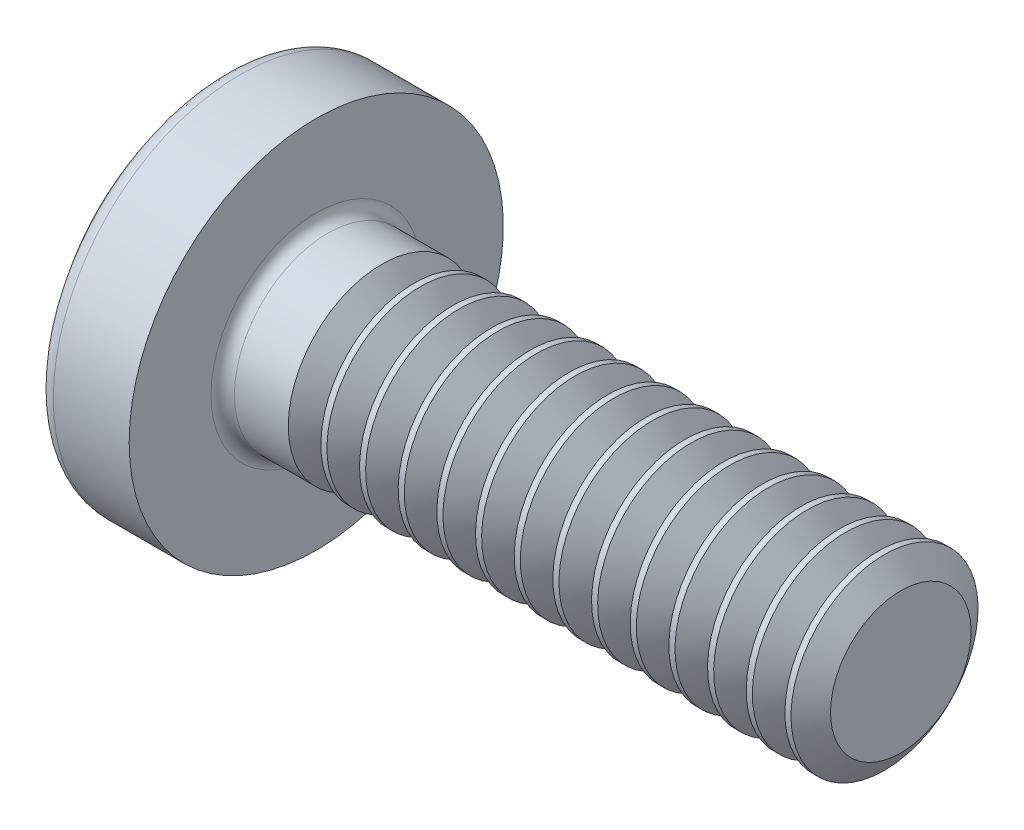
from build123d import *

# Parameters (mm, degrees)
FILLET1_R       = 0.1
RECPAT_COUNT    = 2
RECPAT_ANGLE    = 90
THDSCHPAT_COUNT = 14
THDSCHPAT_PITCH = 0.330769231


with BuildPart() as part:
    # BodySke → Base-Revolve (revolve)
    with BuildSketch(Plane.XY, mode=Mode.PRIVATE) as base_revolve_sk:
        with BuildLine():
            Line((1.3, 0.8), (1.3, 1.6))
            Line((1.3, 1.6), (0.650675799, 1.6))
            ThreePointArc((0.650675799, 1.6), (0.585036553, 1.584875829), (0.532633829, 1.542553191))
            ThreePointArc((0.532633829, 1.542553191), (0.136907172, 0.815960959), (0, 0))
            Line((0, 0), (6.3, 0))
            Line((6.3, 0), (6.3, 0.8))
            Line((6.3, 0.8), (1.3, 0.8))
        make_face()
    revolve(base_revolve_sk.sketch.rotate(Axis((-25.4, 0, 0), (1, 0, 0)), 180), axis=Axis((-25.4, 0, 0), (1, 0, 0)))

    # Fillet1
    fillet1_edges = [part.edges().sort_by_distance(p)[0] for p in [
        (1.3, 0.8, 0),
    ]]
    fillet(fillet1_edges, radius=FILLET1_R)

    # Sketch3 → Recess section 0
    with BuildSketch(Plane(origin=(0, 0, 0), x_dir=(0, 0, -1), z_dir=(1, 0, 0))):
        with BuildLine():
            Line((0.24, -0.8), (-0.24, -0.8))
            Line((-0.24, -0.8), (-0.24, 0.8))
            Line((-0.24, 0.8), (0.24, 0.8))
            Line((0.24, 0.8), (0.24, -0.8))
        make_face()
    # Sketch4 → Recess section 1
    with BuildSketch(Plane(origin=(0.9, 0, 0), x_dir=(0, 0, -1), z_dir=(1, 0, 0))):
        with BuildLine():
            Line((0.24, -0.351276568), (-0.24, -0.351276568))
            Line((-0.24, -0.351276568), (-0.24, 0.351276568))
            Line((-0.24, 0.351276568), (0.24, 0.351276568))
            Line((0.24, 0.351276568), (0.24, -0.351276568))
        make_face()
    recess = loft(mode=Mode.SUBTRACT)

    # RecPat: Recess ×2 about axis
    recpat_axis = Axis((-25.4, 0, 0), (1, 0, 0))
    for i in range(1, RECPAT_COUNT):
        add(recess.rotate(recpat_axis, i * RECPAT_ANGLE / (RECPAT_COUNT - 1)), mode=Mode.SUBTRACT)

    # RecCorSke → RecessCore (revolve, cut)
    with BuildSketch(Plane.XY, mode=Mode.PRIVATE) as recesscore_sk:
        Polygon((0, 0), (0, 0.418434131), (0.9, 0.3555), (1.015508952, 0), align=None)
    revolve(recesscore_sk.sketch.rotate(Axis((-3.175, 0, 0), (1, 0, 0)), 180), axis=Axis((-3.175, 0, 0), (1, 0, 0)), mode=Mode.SUBTRACT)

    # ThdSchSke → ThreadSchematic (revolve, cut)
    with BuildSketch(Plane.XY):
        Polygon((2, -0.601), (1.8606587, -0.8), (1.8606587, -1), (2.1393413, -1), (2.1393413, -0.8), align=None)
    threadschematic = revolve(axis=Axis((-3.175, 0, 0), (1, 0, 0)), mode=Mode.SUBTRACT)

    # ThdSchPat: ThreadSchematic ×14
    with Locations(*[(i * THDSCHPAT_PITCH, 0, 0) for i in range(1, THDSCHPAT_COUNT)]):
        add(threadschematic, mode=Mode.SUBTRACT)


solid = part.part
